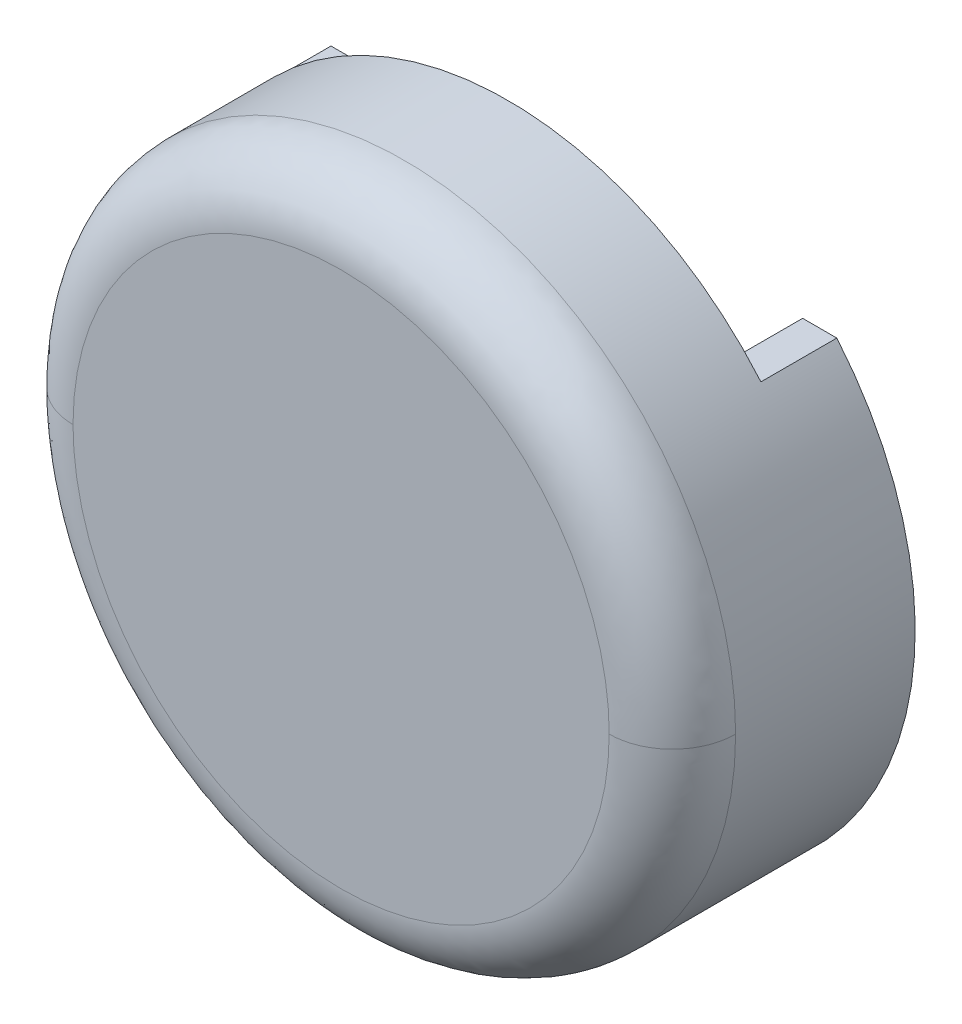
ISO-10303-21;
HEADER;
FILE_DESCRIPTION(('STEP AP214'),'2;1');
FILE_NAME('part.step','',(''),(''),'','','');
FILE_SCHEMA(('AUTOMOTIVE_DESIGN { 1 0 10303 214 1 1 1 1 }'));
ENDSEC;
DATA;
#1=APPLICATION_CONTEXT('core data for automotive mechanical design processes');
#2=APPLICATION_PROTOCOL_DEFINITION('international standard','automotive_design',2000,#1);
#3=PRODUCT_CONTEXT('',#1,'mechanical');
#4=PRODUCT('Part','Part','',(#3));
#5=PRODUCT_RELATED_PRODUCT_CATEGORY('part','',(#4));
#6=PRODUCT_DEFINITION_FORMATION('','',#4);
#7=PRODUCT_DEFINITION_CONTEXT('part definition',#1,'design');
#8=PRODUCT_DEFINITION('design','',#6,#7);
#9=PRODUCT_DEFINITION_SHAPE('','',#8);
#10=(LENGTH_UNIT() NAMED_UNIT(*) SI_UNIT(.MILLI.,.METRE.));
#11=(NAMED_UNIT(*) PLANE_ANGLE_UNIT() SI_UNIT($,.RADIAN.));
#12=(NAMED_UNIT(*) SI_UNIT($,.STERADIAN.) SOLID_ANGLE_UNIT());
#13=UNCERTAINTY_MEASURE_WITH_UNIT(LENGTH_MEASURE(1.E-05),#10,'distance_accuracy_value','');
#14=(GEOMETRIC_REPRESENTATION_CONTEXT(3) GLOBAL_UNCERTAINTY_ASSIGNED_CONTEXT((#13)) GLOBAL_UNIT_ASSIGNED_CONTEXT((#10,
#11,#12)) REPRESENTATION_CONTEXT('',''));
#15=CARTESIAN_POINT('',(0.,0.,0.));
#16=DIRECTION('',(0.,0.,1.));
#17=DIRECTION('',(1.,0.,0.));
#18=AXIS2_PLACEMENT_3D('',#15,#16,#17);
#19=CARTESIAN_POINT('',(-6.811772,-6.811772,6.096));
#20=DIRECTION('',(0.,0.,1.));
#21=DIRECTION('',(1.,0.,0.));
#22=AXIS2_PLACEMENT_3D('',#19,#20,#21);
#23=PLANE('',#22);
#24=CARTESIAN_POINT('',(-6.7309999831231,0.,6.09599999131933));
#25=CARTESIAN_POINT('',(-6.7309999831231,13.4619999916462,6.09599999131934));
#26=CARTESIAN_POINT('',(6.7309999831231,13.4619999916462,6.09599999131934));
#27=CARTESIAN_POINT('',(6.7309999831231,0.,6.09599999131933));
#28=(BOUNDED_CURVE() B_SPLINE_CURVE(3,(#24,#25,#26,#27),.UNSPECIFIED.,.F.,
.F.) B_SPLINE_CURVE_WITH_KNOTS((4,4),(0.,1.),
.UNSPECIFIED.) CURVE() GEOMETRIC_REPRESENTATION_ITEM() RATIONAL_B_SPLINE_CURVE((0.956578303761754,
0.318859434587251,0.318859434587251,0.956578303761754)) REPRESENTATION_ITEM(''));
#29=CARTESIAN_POINT('',(-6.73099998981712,0.,6.0959999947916));
#30=VERTEX_POINT('',#29);
#31=CARTESIAN_POINT('',(6.73099998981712,0.,6.0959999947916));
#32=VERTEX_POINT('',#31);
#33=EDGE_CURVE('E125',#30,#32,#28,.T.);
#34=ORIENTED_EDGE('',*,*,#33,.F.);
#35=CARTESIAN_POINT('',(6.7309999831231,0.,6.09599999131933));
#36=CARTESIAN_POINT('',(6.73099998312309,-13.4619999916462,6.09599999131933));
#37=CARTESIAN_POINT('',(-6.73099998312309,-13.4619999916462,6.09599999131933));
#38=CARTESIAN_POINT('',(-6.7309999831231,0.,6.09599999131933));
#39=(BOUNDED_CURVE() B_SPLINE_CURVE(3,(#35,#36,#37,#38),.UNSPECIFIED.,.F.,
.F.) B_SPLINE_CURVE_WITH_KNOTS((4,4),(0.,1.),
.UNSPECIFIED.) CURVE() GEOMETRIC_REPRESENTATION_ITEM() RATIONAL_B_SPLINE_CURVE((0.956578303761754,
0.318859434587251,0.318859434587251,0.956578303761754)) REPRESENTATION_ITEM(''));
#40=EDGE_CURVE('E136',#32,#30,#39,.T.);
#41=ORIENTED_EDGE('',*,*,#40,.F.);
#42=EDGE_LOOP('',(#34,#41));
#43=FACE_BOUND('',#42,.T.);
#44=ADVANCED_FACE('F15',(#43),#23,.T.);
#45=CARTESIAN_POINT('',(-6.5725144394,0.,6.088069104));
#46=CARTESIAN_POINT('',(-6.5725144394,-13.1450289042,6.088069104));
#47=CARTESIAN_POINT('',(6.5725144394,-13.1450289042,6.088069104));
#48=CARTESIAN_POINT('',(6.5725144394,0.,6.088069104));
#49=CARTESIAN_POINT('',(-7.651835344,0.,6.1963624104));
#50=CARTESIAN_POINT('',(-7.651835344,-15.3036707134,6.1963624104));
#51=CARTESIAN_POINT('',(7.651835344,-15.3036707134,6.1963624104));
#52=CARTESIAN_POINT('',(7.651835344,0.,6.1963624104));
#53=CARTESIAN_POINT('',(-8.4188624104,0.,5.429335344));
#54=CARTESIAN_POINT('',(-8.4188624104,-16.8377248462,5.429335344));
#55=CARTESIAN_POINT('',(8.4188624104,-16.8377248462,5.429335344));
#56=CARTESIAN_POINT('',(8.4188624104,0.,5.429335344));
#57=CARTESIAN_POINT('',(-8.310569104,0.,4.3500144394));
#58=CARTESIAN_POINT('',(-8.310569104,-16.6211382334,4.3500144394));
#59=CARTESIAN_POINT('',(8.310569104,-16.6211382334,4.3500144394));
#60=CARTESIAN_POINT('',(8.310569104,0.,4.3500144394));
#61=(BOUNDED_SURFACE() B_SPLINE_SURFACE(3,3,((#45,#46,#47,#48),(#49,#50,#51,#52),(#53,#54,#55,
#56),(#57,#58,#59,#60)),.UNSPECIFIED.,.F.,.F.,.F.) B_SPLINE_SURFACE_WITH_KNOTS((4,4),(4,4),(0.,
1.),(0.,1.),.UNSPECIFIED.) GEOMETRIC_REPRESENTATION_ITEM() RATIONAL_B_SPLINE_SURFACE(((1.,
0.333333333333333,0.333333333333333,1.),(0.755320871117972,0.251773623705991,0.251773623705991,
0.755320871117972),(0.755320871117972,0.251773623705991,0.251773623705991,0.755320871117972),
(1.,0.333333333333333,0.333333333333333,1.))) REPRESENTATION_ITEM('') SURFACE());
#62=CARTESIAN_POINT('',(6.5725144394,0.,6.088069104));
#63=CARTESIAN_POINT('',(7.651835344,0.,6.1963624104));
#64=CARTESIAN_POINT('',(8.4188624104,0.,5.429335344));
#65=CARTESIAN_POINT('',(8.310569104,0.,4.3500144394));
#66=(BOUNDED_CURVE() B_SPLINE_CURVE(3,(#62,#63,#64,#65),.UNSPECIFIED.,.F.,
.F.) B_SPLINE_CURVE_WITH_KNOTS((4,4),(0.,1.),
.UNSPECIFIED.) CURVE() GEOMETRIC_REPRESENTATION_ITEM() RATIONAL_B_SPLINE_CURVE((1.,
0.755320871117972,0.755320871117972,1.)) REPRESENTATION_ITEM(''));
#67=CARTESIAN_POINT('',(8.31849999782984,-2.55922930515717E-09,4.5085));
#68=VERTEX_POINT('',#67);
#69=EDGE_CURVE('E117',#32,#68,#66,.T.);
#70=CARTESIAN_POINT('',(-6.5725144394,0.,6.088069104));
#71=CARTESIAN_POINT('',(-7.651835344,0.,6.1963624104));
#72=CARTESIAN_POINT('',(-8.4188624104,0.,5.429335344));
#73=CARTESIAN_POINT('',(-8.310569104,0.,4.3500144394));
#74=(BOUNDED_CURVE() B_SPLINE_CURVE(3,(#70,#71,#72,#73),.UNSPECIFIED.,.F.,
.F.) B_SPLINE_CURVE_WITH_KNOTS((4,4),(0.,1.),
.UNSPECIFIED.) CURVE() GEOMETRIC_REPRESENTATION_ITEM() RATIONAL_B_SPLINE_CURVE((1.,
0.755320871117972,0.755320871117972,1.)) REPRESENTATION_ITEM(''));
#75=CARTESIAN_POINT('',(-8.31849999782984,-3.73474149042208E-10,4.5085));
#76=VERTEX_POINT('',#75);
#77=EDGE_CURVE('E130',#76,#30,#74,.F.);
#78=CARTESIAN_POINT('',(0.,0.,4.5085));
#79=DIRECTION('',(0.,0.,-1.));
#80=DIRECTION('',(-1.,0.,0.));
#81=AXIS2_PLACEMENT_3D('',#78,#79,#80);
#82=CIRCLE('',#81,8.3185);
#83=EDGE_CURVE('E114',#76,#68,#82,.F.);
#84=ORIENTED_EDGE('',*,*,#69,.F.);
#85=ORIENTED_EDGE('',*,*,#40,.T.);
#86=ORIENTED_EDGE('',*,*,#77,.F.);
#87=ORIENTED_EDGE('',*,*,#83,.T.);
#88=EDGE_LOOP('',(#84,#85,#86,#87));
#89=FACE_BOUND('',#88,.T.);
#90=ADVANCED_FACE('F165',(#89),#61,.T.);
#91=CARTESIAN_POINT('',(6.5725144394,0.,6.088069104));
#92=CARTESIAN_POINT('',(6.5725144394,13.1450289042,6.088069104));
#93=CARTESIAN_POINT('',(-6.5725144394,13.1450289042,6.088069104));
#94=CARTESIAN_POINT('',(-6.5725144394,0.,6.088069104));
#95=CARTESIAN_POINT('',(7.651835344,0.,6.1963624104));
#96=CARTESIAN_POINT('',(7.651835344,15.3036707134,6.1963624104));
#97=CARTESIAN_POINT('',(-7.651835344,15.3036707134,6.1963624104));
#98=CARTESIAN_POINT('',(-7.651835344,0.,6.1963624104));
#99=CARTESIAN_POINT('',(8.4188624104,0.,5.429335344));
#100=CARTESIAN_POINT('',(8.4188624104,16.8377248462,5.429335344));
#101=CARTESIAN_POINT('',(-8.4188624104,16.8377248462,5.429335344));
#102=CARTESIAN_POINT('',(-8.4188624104,0.,5.429335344));
#103=CARTESIAN_POINT('',(8.310569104,0.,4.3500144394));
#104=CARTESIAN_POINT('',(8.310569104,16.6211382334,4.3500144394));
#105=CARTESIAN_POINT('',(-8.310569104,16.6211382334,4.3500144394));
#106=CARTESIAN_POINT('',(-8.310569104,0.,4.3500144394));
#107=(BOUNDED_SURFACE() B_SPLINE_SURFACE(3,3,((#91,#92,#93,#94),(#95,#96,#97,#98),(#99,#100,
#101,#102),(#103,#104,#105,#106)),.UNSPECIFIED.,.F.,.F.,.F.) B_SPLINE_SURFACE_WITH_KNOTS((4,4),
(4,4),(0.,1.),(0.,1.),
.UNSPECIFIED.) GEOMETRIC_REPRESENTATION_ITEM() RATIONAL_B_SPLINE_SURFACE(((1.,0.333333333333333,
0.333333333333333,1.),(0.755320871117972,0.251773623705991,0.251773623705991,0.755320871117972),
(0.755320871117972,0.251773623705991,0.251773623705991,0.755320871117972),(1.,0.333333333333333,
0.333333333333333,1.))) REPRESENTATION_ITEM('') SURFACE());
#108=CARTESIAN_POINT('',(0.,0.,4.5085));
#109=DIRECTION('',(0.,0.,-1.));
#110=DIRECTION('',(-1.,0.,0.));
#111=AXIS2_PLACEMENT_3D('',#108,#109,#110);
#112=CIRCLE('',#111,8.3185);
#113=EDGE_CURVE('E94',#68,#76,#112,.F.);
#114=ORIENTED_EDGE('',*,*,#33,.T.);
#115=ORIENTED_EDGE('',*,*,#69,.T.);
#116=ORIENTED_EDGE('',*,*,#113,.T.);
#117=ORIENTED_EDGE('',*,*,#77,.T.);
#118=EDGE_LOOP('',(#114,#115,#116,#117));
#119=FACE_BOUND('',#118,.T.);
#120=ADVANCED_FACE('F153',(#119),#107,.T.);
#121=CARTESIAN_POINT('',(0.,0.,4.5085));
#122=DIRECTION('',(0.,0.,-1.));
#123=DIRECTION('',(-1.,0.,0.));
#124=AXIS2_PLACEMENT_3D('',#121,#122,#123);
#125=CYLINDRICAL_SURFACE('',#124,8.3185);
#126=CARTESIAN_POINT('',(0.,0.,0.));
#127=DIRECTION('',(0.,0.,-1.));
#128=DIRECTION('',(-1.,0.,0.));
#129=AXIS2_PLACEMENT_3D('',#126,#127,#128);
#130=CIRCLE('',#129,8.3185);
#131=CARTESIAN_POINT('',(-6.34999999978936,5.373540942,0.));
#132=VERTEX_POINT('',#131);
#133=CARTESIAN_POINT('',(6.34999999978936,5.373540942,0.));
#134=VERTEX_POINT('',#133);
#135=EDGE_CURVE('E104',#132,#134,#130,.F.);
#136=ORIENTED_EDGE('',*,*,#135,.T.);
#137=DIRECTION('',(0.,0.,1.));
#138=VECTOR('',#137,1.);
#139=CARTESIAN_POINT('',(6.35,5.373540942,0.9525));
#140=LINE('',#139,#138);
#141=CARTESIAN_POINT('',(6.34999999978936,5.373540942,1.90499999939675));
#142=VERTEX_POINT('',#141);
#143=EDGE_CURVE('E98',#134,#142,#140,.T.);
#144=ORIENTED_EDGE('',*,*,#143,.T.);
#145=CARTESIAN_POINT('',(0.,0.,1.9049999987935));
#146=DIRECTION('',(0.,0.,-1.));
#147=DIRECTION('',(-1.,0.,0.));
#148=AXIS2_PLACEMENT_3D('',#145,#146,#147);
#149=CIRCLE('',#148,8.3185);
#150=CARTESIAN_POINT('',(-6.34999999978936,5.373540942,1.90499999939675));
#151=VERTEX_POINT('',#150);
#152=EDGE_CURVE('E20',#142,#151,#149,.F.);
#153=ORIENTED_EDGE('',*,*,#152,.T.);
#154=DIRECTION('',(0.,0.,-1.));
#155=VECTOR('',#154,1.);
#156=CARTESIAN_POINT('',(-6.35,5.373540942,0.9525));
#157=LINE('',#156,#155);
#158=EDGE_CURVE('E85',#151,#132,#157,.T.);
#159=ORIENTED_EDGE('',*,*,#158,.T.);
#160=EDGE_LOOP('',(#136,#144,#153,#159));
#161=FACE_BOUND('',#160,.T.);
#162=ORIENTED_EDGE('',*,*,#113,.F.);
#163=ORIENTED_EDGE('',*,*,#83,.F.);
#164=EDGE_LOOP('',(#162,#163));
#165=FACE_BOUND('',#164,.T.);
#166=ADVANCED_FACE('F101',(#161,#165),#125,.T.);
#167=CARTESIAN_POINT('',(-6.35,5.373540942,1.905));
#168=DIRECTION('',(0.,-1.,0.));
#169=DIRECTION('',(0.,0.,-1.));
#170=AXIS2_PLACEMENT_3D('',#167,#168,#169);
#171=PLANE('',#170);
#172=DIRECTION('',(-1.,0.,0.));
#173=VECTOR('',#172,1.);
#174=CARTESIAN_POINT('',(0.,5.373540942,0.));
#175=LINE('',#174,#173);
#176=CARTESIAN_POINT('',(-5.49192406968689,5.37354094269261,0.));
#177=VERTEX_POINT('',#176);
#178=EDGE_CURVE('E91',#177,#132,#175,.T.);
#179=ORIENTED_EDGE('',*,*,#178,.T.);
#180=ORIENTED_EDGE('',*,*,#158,.F.);
#181=DIRECTION('',(1.,0.,0.));
#182=VECTOR('',#181,1.);
#183=CARTESIAN_POINT('',(0.,5.373540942,1.905));
#184=LINE('',#183,#182);
#185=CARTESIAN_POINT('',(-5.49192406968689,5.37354094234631,1.90499999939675));
#186=VERTEX_POINT('',#185);
#187=EDGE_CURVE('E88',#151,#186,#184,.T.);
#188=ORIENTED_EDGE('',*,*,#187,.T.);
#189=DIRECTION('',(0.,0.,-1.));
#190=VECTOR('',#189,1.);
#191=CARTESIAN_POINT('',(-5.49192406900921,5.37354094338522,2.25425));
#192=LINE('',#191,#190);
#193=EDGE_CURVE('E239',#177,#186,#192,.F.);
#194=ORIENTED_EDGE('',*,*,#193,.F.);
#195=EDGE_LOOP('',(#179,#180,#188,#194));
#196=FACE_BOUND('',#195,.T.);
#197=ADVANCED_FACE('F86',(#196),#171,.F.);
#198=CARTESIAN_POINT('',(-6.4262,5.373540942,1.905));
#199=DIRECTION('',(0.,0.,1.));
#200=DIRECTION('',(1.,0.,0.));
#201=AXIS2_PLACEMENT_3D('',#198,#199,#200);
#202=PLANE('',#201);
#203=CARTESIAN_POINT('',(0.,0.,1.9049999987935));
#204=DIRECTION('',(0.,0.,-1.));
#205=DIRECTION('',(-1.,0.,0.));
#206=AXIS2_PLACEMENT_3D('',#203,#204,#205);
#207=CIRCLE('',#206,7.6835);
#208=CARTESIAN_POINT('',(5.49192407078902,5.3735409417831,1.90499999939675));
#209=VERTEX_POINT('',#208);
#210=EDGE_CURVE('E97',#186,#209,#207,.T.);
#211=ORIENTED_EDGE('',*,*,#210,.F.);
#212=ORIENTED_EDGE('',*,*,#187,.F.);
#213=ORIENTED_EDGE('',*,*,#152,.F.);
#214=DIRECTION('',(-1.,0.,0.));
#215=VECTOR('',#214,1.);
#216=CARTESIAN_POINT('',(5.9209620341,5.373540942,1.905));
#217=LINE('',#216,#215);
#218=EDGE_CURVE('E108',#142,#209,#217,.T.);
#219=ORIENTED_EDGE('',*,*,#218,.T.);
#220=EDGE_LOOP('',(#211,#212,#213,#219));
#221=FACE_BOUND('',#220,.T.);
#222=ADVANCED_FACE('F96',(#221),#202,.F.);
#223=CARTESIAN_POINT('',(5.4919240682,5.373540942,1.905));
#224=DIRECTION('',(0.,-1.,0.));
#225=DIRECTION('',(0.,0.,-1.));
#226=AXIS2_PLACEMENT_3D('',#223,#224,#225);
#227=PLANE('',#226);
#228=ORIENTED_EDGE('',*,*,#218,.F.);
#229=ORIENTED_EDGE('',*,*,#143,.F.);
#230=DIRECTION('',(-1.,0.,0.));
#231=VECTOR('',#230,1.);
#232=CARTESIAN_POINT('',(0.,5.373540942,0.));
#233=LINE('',#232,#231);
#234=CARTESIAN_POINT('',(5.49192407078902,5.3735409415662,0.));
#235=VERTEX_POINT('',#234);
#236=EDGE_CURVE('E242',#134,#235,#233,.T.);
#237=ORIENTED_EDGE('',*,*,#236,.T.);
#238=DIRECTION('',(0.,0.,1.));
#239=VECTOR('',#238,1.);
#240=CARTESIAN_POINT('',(5.49192407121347,5.3735409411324,2.25425));
#241=LINE('',#240,#239);
#242=EDGE_CURVE('E238',#209,#235,#241,.F.);
#243=ORIENTED_EDGE('',*,*,#242,.F.);
#244=EDGE_LOOP('',(#228,#229,#237,#243));
#245=FACE_BOUND('',#244,.T.);
#246=ADVANCED_FACE('F272',(#245),#227,.F.);
#247=CARTESIAN_POINT('',(6.6359086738,0.,5.4562414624));
#248=CARTESIAN_POINT('',(6.6359086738,13.2718173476,5.4562414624));
#249=CARTESIAN_POINT('',(-6.6359086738,13.2718173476,5.4562414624));
#250=CARTESIAN_POINT('',(-6.6359086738,0.,5.4562414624));
#251=CARTESIAN_POINT('',(7.2835012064,0.,5.5212174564));
#252=CARTESIAN_POINT('',(7.2835012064,14.5670024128,5.5212174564));
#253=CARTESIAN_POINT('',(-7.2835012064,14.5670024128,5.5212174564));
#254=CARTESIAN_POINT('',(-7.2835012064,0.,5.5212174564));
#255=CARTESIAN_POINT('',(7.7437174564,0.,5.0610012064));
#256=CARTESIAN_POINT('',(7.7437174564,15.4874349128,5.0610012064));
#257=CARTESIAN_POINT('',(-7.7437174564,15.4874349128,5.0610012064));
#258=CARTESIAN_POINT('',(-7.7437174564,0.,5.0610012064));
#259=CARTESIAN_POINT('',(7.6787414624,0.,4.4134086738));
#260=CARTESIAN_POINT('',(7.6787414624,15.3574829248,4.4134086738));
#261=CARTESIAN_POINT('',(-7.6787414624,15.3574829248,4.4134086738));
#262=CARTESIAN_POINT('',(-7.6787414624,0.,4.4134086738));
#263=(BOUNDED_SURFACE() B_SPLINE_SURFACE(3,3,((#247,#248,#249,#250),(#251,#252,#253,#254),(#255,
#256,#257,#258),(#259,#260,#261,#262)),.UNSPECIFIED.,.F.,.F.,
.F.) B_SPLINE_SURFACE_WITH_KNOTS((4,4),(4,4),(0.,1.),(0.,1.),
.UNSPECIFIED.) GEOMETRIC_REPRESENTATION_ITEM() RATIONAL_B_SPLINE_SURFACE(((1.,0.333333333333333,
0.333333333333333,1.),(0.755320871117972,0.251773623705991,0.251773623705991,0.755320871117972),
(0.755320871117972,0.251773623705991,0.251773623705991,0.755320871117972),(1.,0.333333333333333,
0.333333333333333,1.))) REPRESENTATION_ITEM('') SURFACE());
#264=CARTESIAN_POINT('',(0.,0.,4.5085));
#265=DIRECTION('',(0.,0.,-1.));
#266=DIRECTION('',(-1.,0.,0.));
#267=AXIS2_PLACEMENT_3D('',#264,#265,#266);
#268=CIRCLE('',#267,7.6835);
#269=CARTESIAN_POINT('',(7.68349999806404,-1.57591219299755E-09,4.50850000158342));
#270=VERTEX_POINT('',#269);
#271=CARTESIAN_POINT('',(-7.68349999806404,-5.17447008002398E-10,4.50850000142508));
#272=VERTEX_POINT('',#271);
#273=EDGE_CURVE('E240',#270,#272,#268,.F.);
#274=CARTESIAN_POINT('',(6.6359086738,0.,5.4562414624));
#275=CARTESIAN_POINT('',(7.2835012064,0.,5.5212174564));
#276=CARTESIAN_POINT('',(7.7437174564,0.,5.0610012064));
#277=CARTESIAN_POINT('',(7.6787414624,0.,4.4134086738));
#278=(BOUNDED_CURVE() B_SPLINE_CURVE(3,(#274,#275,#276,#277),.UNSPECIFIED.,.F.,
.F.) B_SPLINE_CURVE_WITH_KNOTS((4,4),(0.,1.),
.UNSPECIFIED.) CURVE() GEOMETRIC_REPRESENTATION_ITEM() RATIONAL_B_SPLINE_CURVE((1.,
0.755320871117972,0.755320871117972,1.)) REPRESENTATION_ITEM(''));
#279=CARTESIAN_POINT('',(6.73100000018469,0.,5.46099999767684));
#280=VERTEX_POINT('',#279);
#281=EDGE_CURVE('E110',#280,#270,#278,.T.);
#282=CARTESIAN_POINT('',(6.73100000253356,0.,5.46099999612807));
#283=CARTESIAN_POINT('',(6.73100000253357,13.4620000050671,5.46099999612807));
#284=CARTESIAN_POINT('',(-6.73100000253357,13.4620000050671,5.46099999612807));
#285=CARTESIAN_POINT('',(-6.73100000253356,0.,5.46099999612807));
#286=(BOUNDED_CURVE() B_SPLINE_CURVE(3,(#282,#283,#284,#285),.UNSPECIFIED.,.F.,
.F.) B_SPLINE_CURVE_WITH_KNOTS((4,4),(0.,1.),
.UNSPECIFIED.) CURVE() GEOMETRIC_REPRESENTATION_ITEM() RATIONAL_B_SPLINE_CURVE((0.956578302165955,
0.318859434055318,0.318859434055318,0.956578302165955)) REPRESENTATION_ITEM(''));
#287=CARTESIAN_POINT('',(-6.73100000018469,0.,5.46099999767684));
#288=VERTEX_POINT('',#287);
#289=EDGE_CURVE('E227',#280,#288,#286,.T.);
#290=CARTESIAN_POINT('',(-6.6359086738,0.,5.4562414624));
#291=CARTESIAN_POINT('',(-7.2835012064,0.,5.5212174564));
#292=CARTESIAN_POINT('',(-7.7437174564,0.,5.0610012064));
#293=CARTESIAN_POINT('',(-7.6787414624,0.,4.4134086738));
#294=(BOUNDED_CURVE() B_SPLINE_CURVE(3,(#290,#291,#292,#293),.UNSPECIFIED.,.F.,
.F.) B_SPLINE_CURVE_WITH_KNOTS((4,4),(0.,1.),
.UNSPECIFIED.) CURVE() GEOMETRIC_REPRESENTATION_ITEM() RATIONAL_B_SPLINE_CURVE((1.,
0.755320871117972,0.755320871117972,1.)) REPRESENTATION_ITEM(''));
#295=EDGE_CURVE('E35',#272,#288,#294,.F.);
#296=ORIENTED_EDGE('',*,*,#273,.F.);
#297=ORIENTED_EDGE('',*,*,#281,.F.);
#298=ORIENTED_EDGE('',*,*,#289,.T.);
#299=ORIENTED_EDGE('',*,*,#295,.F.);
#300=EDGE_LOOP('',(#296,#297,#298,#299));
#301=FACE_BOUND('',#300,.T.);
#302=ADVANCED_FACE('F260',(#301),#263,.F.);
#303=CARTESIAN_POINT('',(-8.418322,-8.400652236,0.));
#304=DIRECTION('',(0.,0.,1.));
#305=DIRECTION('',(1.,0.,0.));
#306=AXIS2_PLACEMENT_3D('',#303,#304,#305);
#307=PLANE('',#306);
#308=ORIENTED_EDGE('',*,*,#178,.F.);
#309=CARTESIAN_POINT('',(0.,0.,0.));
#310=DIRECTION('',(0.,0.,-1.));
#311=DIRECTION('',(-1.,0.,0.));
#312=AXIS2_PLACEMENT_3D('',#309,#310,#311);
#313=CIRCLE('',#312,7.6835);
#314=EDGE_CURVE('E231',#235,#177,#313,.T.);
#315=ORIENTED_EDGE('',*,*,#314,.F.);
#316=ORIENTED_EDGE('',*,*,#236,.F.);
#317=ORIENTED_EDGE('',*,*,#135,.F.);
#318=EDGE_LOOP('',(#308,#315,#316,#317));
#319=FACE_BOUND('',#318,.T.);
#320=ADVANCED_FACE('F271',(#319),#307,.F.);
#321=CARTESIAN_POINT('',(-6.811772,-6.811772,5.461));
#322=DIRECTION('',(0.,0.,1.));
#323=DIRECTION('',(1.,0.,0.));
#324=AXIS2_PLACEMENT_3D('',#321,#322,#323);
#325=PLANE('',#324);
#326=CARTESIAN_POINT('',(-6.73100000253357,0.,5.46099999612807));
#327=CARTESIAN_POINT('',(-6.73100000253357,-13.4620000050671,5.46099999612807));
#328=CARTESIAN_POINT('',(6.73100000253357,-13.4620000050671,5.46099999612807));
#329=CARTESIAN_POINT('',(6.73100000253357,0.,5.46099999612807));
#330=(BOUNDED_CURVE() B_SPLINE_CURVE(3,(#326,#327,#328,#329),.UNSPECIFIED.,.F.,
.F.) B_SPLINE_CURVE_WITH_KNOTS((4,4),(0.,1.),
.UNSPECIFIED.) CURVE() GEOMETRIC_REPRESENTATION_ITEM() RATIONAL_B_SPLINE_CURVE((0.956578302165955,
0.318859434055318,0.318859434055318,0.956578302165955)) REPRESENTATION_ITEM(''));
#331=EDGE_CURVE('E26',#280,#288,#330,.F.);
#332=ORIENTED_EDGE('',*,*,#331,.T.);
#333=ORIENTED_EDGE('',*,*,#289,.F.);
#334=EDGE_LOOP('',(#332,#333));
#335=FACE_BOUND('',#334,.T.);
#336=ADVANCED_FACE('F17',(#335),#325,.F.);
#337=CARTESIAN_POINT('',(0.,0.,4.5085));
#338=DIRECTION('',(0.,0.,-1.));
#339=DIRECTION('',(-1.,0.,0.));
#340=AXIS2_PLACEMENT_3D('',#337,#338,#339);
#341=CYLINDRICAL_SURFACE('',#340,7.6835);
#342=ORIENTED_EDGE('',*,*,#242,.T.);
#343=ORIENTED_EDGE('',*,*,#314,.T.);
#344=ORIENTED_EDGE('',*,*,#193,.T.);
#345=ORIENTED_EDGE('',*,*,#210,.T.);
#346=EDGE_LOOP('',(#342,#343,#344,#345));
#347=FACE_BOUND('',#346,.T.);
#348=CARTESIAN_POINT('',(0.,0.,4.50850000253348));
#349=DIRECTION('',(0.,0.,1.));
#350=DIRECTION('',(0.,-1.,0.));
#351=AXIS2_PLACEMENT_3D('',#348,#349,#350);
#352=CIRCLE('',#351,7.68349999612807);
#353=EDGE_CURVE('E10',#272,#270,#352,.T.);
#354=ORIENTED_EDGE('',*,*,#353,.T.);
#355=ORIENTED_EDGE('',*,*,#273,.T.);
#356=EDGE_LOOP('',(#354,#355));
#357=FACE_BOUND('',#356,.T.);
#358=ADVANCED_FACE('F273',(#347,#357),#341,.F.);
#359=CARTESIAN_POINT('',(-6.6359086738,0.,5.4562414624));
#360=CARTESIAN_POINT('',(-6.6359086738,-13.2718173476,5.4562414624));
#361=CARTESIAN_POINT('',(6.6359086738,-13.2718173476,5.4562414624));
#362=CARTESIAN_POINT('',(6.6359086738,0.,5.4562414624));
#363=CARTESIAN_POINT('',(-7.2835012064,0.,5.5212174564));
#364=CARTESIAN_POINT('',(-7.2835012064,-14.5670024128,5.5212174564));
#365=CARTESIAN_POINT('',(7.2835012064,-14.5670024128,5.5212174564));
#366=CARTESIAN_POINT('',(7.2835012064,0.,5.5212174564));
#367=CARTESIAN_POINT('',(-7.7437174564,0.,5.0610012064));
#368=CARTESIAN_POINT('',(-7.7437174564,-15.4874349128,5.0610012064));
#369=CARTESIAN_POINT('',(7.7437174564,-15.4874349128,5.0610012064));
#370=CARTESIAN_POINT('',(7.7437174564,0.,5.0610012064));
#371=CARTESIAN_POINT('',(-7.6787414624,0.,4.4134086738));
#372=CARTESIAN_POINT('',(-7.6787414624,-15.3574829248,4.4134086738));
#373=CARTESIAN_POINT('',(7.6787414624,-15.3574829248,4.4134086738));
#374=CARTESIAN_POINT('',(7.6787414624,0.,4.4134086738));
#375=(BOUNDED_SURFACE() B_SPLINE_SURFACE(3,3,((#359,#360,#361,#362),(#363,#364,#365,#366),(#367,
#368,#369,#370),(#371,#372,#373,#374)),.UNSPECIFIED.,.F.,.F.,
.F.) B_SPLINE_SURFACE_WITH_KNOTS((4,4),(4,4),(0.,1.),(0.,1.),
.UNSPECIFIED.) GEOMETRIC_REPRESENTATION_ITEM() RATIONAL_B_SPLINE_SURFACE(((1.,0.333333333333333,
0.333333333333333,1.),(0.755320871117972,0.251773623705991,0.251773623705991,0.755320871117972),
(0.755320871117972,0.251773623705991,0.251773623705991,0.755320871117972),(1.,0.333333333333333,
0.333333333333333,1.))) REPRESENTATION_ITEM('') SURFACE());
#376=ORIENTED_EDGE('',*,*,#295,.T.);
#377=ORIENTED_EDGE('',*,*,#331,.F.);
#378=ORIENTED_EDGE('',*,*,#281,.T.);
#379=ORIENTED_EDGE('',*,*,#353,.F.);
#380=EDGE_LOOP('',(#376,#377,#378,#379));
#381=FACE_BOUND('',#380,.T.);
#382=ADVANCED_FACE('F280',(#381),#375,.F.);
#383=CLOSED_SHELL('',(#44,#90,#120,#166,#197,#222,#246,#302,#320,#336,#358,#382));
#384=MANIFOLD_SOLID_BREP('B1',#383);
#385=ADVANCED_BREP_SHAPE_REPRESENTATION('',(#18,#384),#14);
#386=SHAPE_DEFINITION_REPRESENTATION(#9,#385);
ENDSEC;
END-ISO-10303-21;
